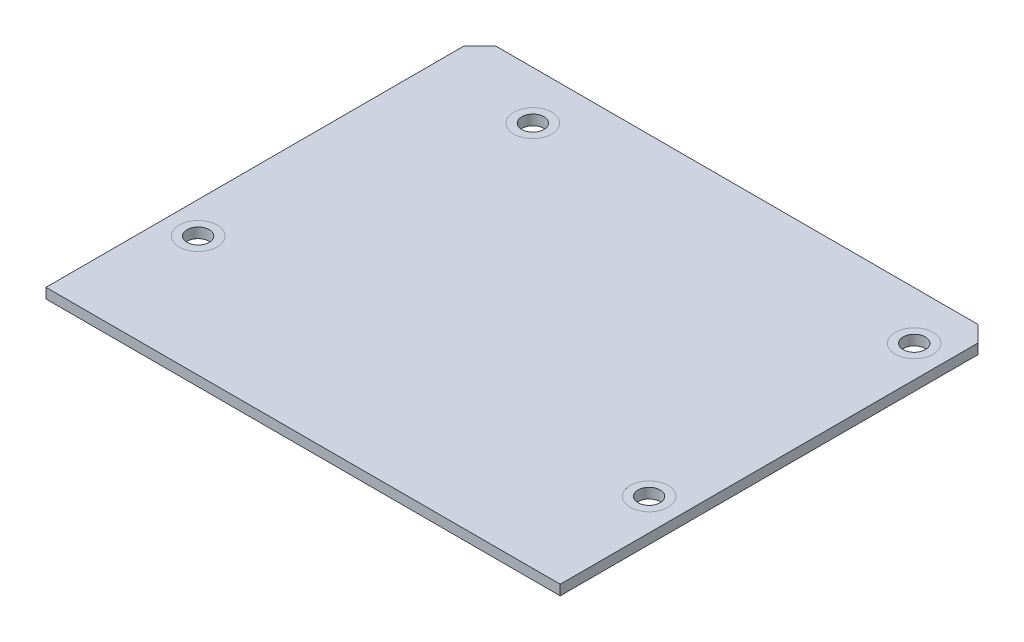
ISO-10303-21;
HEADER;
FILE_DESCRIPTION(('STEP AP214'),'2;1');
FILE_NAME('part.step','',(''),(''),'','','');
FILE_SCHEMA(('AUTOMOTIVE_DESIGN { 1 0 10303 214 1 1 1 1 }'));
ENDSEC;
DATA;
#1=APPLICATION_CONTEXT('core data for automotive mechanical design processes');
#2=APPLICATION_PROTOCOL_DEFINITION('international standard','automotive_design',2000,#1);
#3=PRODUCT_CONTEXT('',#1,'mechanical');
#4=PRODUCT('Part','Part','',(#3));
#5=PRODUCT_RELATED_PRODUCT_CATEGORY('part','',(#4));
#6=PRODUCT_DEFINITION_FORMATION('','',#4);
#7=PRODUCT_DEFINITION_CONTEXT('part definition',#1,'design');
#8=PRODUCT_DEFINITION('design','',#6,#7);
#9=PRODUCT_DEFINITION_SHAPE('','',#8);
#10=(LENGTH_UNIT() NAMED_UNIT(*) SI_UNIT(.MILLI.,.METRE.));
#11=(NAMED_UNIT(*) PLANE_ANGLE_UNIT() SI_UNIT($,.RADIAN.));
#12=(NAMED_UNIT(*) SI_UNIT($,.STERADIAN.) SOLID_ANGLE_UNIT());
#13=UNCERTAINTY_MEASURE_WITH_UNIT(LENGTH_MEASURE(1.E-05),#10,'distance_accuracy_value','');
#14=(GEOMETRIC_REPRESENTATION_CONTEXT(3) GLOBAL_UNCERTAINTY_ASSIGNED_CONTEXT((#13)) GLOBAL_UNIT_ASSIGNED_CONTEXT((#10,
#11,#12)) REPRESENTATION_CONTEXT('',''));
#15=CARTESIAN_POINT('',(0.,0.,0.));
#16=DIRECTION('',(0.,0.,1.));
#17=DIRECTION('',(1.,0.,0.));
#18=AXIS2_PLACEMENT_3D('',#15,#16,#17);
#19=CARTESIAN_POINT('',(35.64,-0.000999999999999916,15.24));
#20=DIRECTION('',(0.,1.,0.));
#21=DIRECTION('',(0.,0.,1.));
#22=AXIS2_PLACEMENT_3D('',#19,#20,#21);
#23=CYLINDRICAL_SURFACE('',#22,1.75);
#24=CARTESIAN_POINT('',(35.64,0.,15.24));
#25=DIRECTION('',(0.,1.,0.));
#26=DIRECTION('',(0.,0.,1.));
#27=AXIS2_PLACEMENT_3D('',#24,#25,#26);
#28=CIRCLE('',#27,1.75);
#29=CARTESIAN_POINT('',(35.64,0.,16.99));
#30=VERTEX_POINT('',#29);
#31=EDGE_CURVE('E168',#30,#30,#28,.F.);
#32=ORIENTED_EDGE('',*,*,#31,.T.);
#33=EDGE_LOOP('',(#32));
#34=FACE_BOUND('',#33,.T.);
#35=CARTESIAN_POINT('',(35.64,1.5999,15.24));
#36=DIRECTION('',(0.,1.,0.));
#37=DIRECTION('',(0.,0.,1.));
#38=AXIS2_PLACEMENT_3D('',#35,#36,#37);
#39=CIRCLE('',#38,1.75);
#40=CARTESIAN_POINT('',(35.64,1.5999,16.99));
#41=VERTEX_POINT('',#40);
#42=EDGE_CURVE('E34',#41,#41,#39,.F.);
#43=ORIENTED_EDGE('',*,*,#42,.F.);
#44=EDGE_LOOP('',(#43));
#45=FACE_BOUND('',#44,.T.);
#46=ADVANCED_FACE('F30',(#34,#45),#23,.F.);
#47=CARTESIAN_POINT('',(-35.64,-0.000999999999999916,15.24));
#48=DIRECTION('',(0.,1.,0.));
#49=DIRECTION('',(0.,0.,1.));
#50=AXIS2_PLACEMENT_3D('',#47,#48,#49);
#51=CYLINDRICAL_SURFACE('',#50,1.75);
#52=CARTESIAN_POINT('',(-35.64,0.,15.24));
#53=DIRECTION('',(0.,1.,0.));
#54=DIRECTION('',(0.,0.,1.));
#55=AXIS2_PLACEMENT_3D('',#52,#53,#54);
#56=CIRCLE('',#55,1.75);
#57=CARTESIAN_POINT('',(-35.64,0.,16.99));
#58=VERTEX_POINT('',#57);
#59=EDGE_CURVE('E135',#58,#58,#56,.F.);
#60=ORIENTED_EDGE('',*,*,#59,.T.);
#61=EDGE_LOOP('',(#60));
#62=FACE_BOUND('',#61,.T.);
#63=CARTESIAN_POINT('',(-35.64,1.5999,15.24));
#64=DIRECTION('',(0.,1.,0.));
#65=DIRECTION('',(0.,0.,1.));
#66=AXIS2_PLACEMENT_3D('',#63,#64,#65);
#67=CIRCLE('',#66,1.75);
#68=CARTESIAN_POINT('',(-35.64,1.5999,16.99));
#69=VERTEX_POINT('',#68);
#70=EDGE_CURVE('E141',#69,#69,#67,.F.);
#71=ORIENTED_EDGE('',*,*,#70,.F.);
#72=EDGE_LOOP('',(#71));
#73=FACE_BOUND('',#72,.T.);
#74=ADVANCED_FACE('F200',(#62,#73),#51,.F.);
#75=CARTESIAN_POINT('',(35.64,-0.000999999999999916,-26.67));
#76=DIRECTION('',(0.,1.,0.));
#77=DIRECTION('',(0.,0.,1.));
#78=AXIS2_PLACEMENT_3D('',#75,#76,#77);
#79=CYLINDRICAL_SURFACE('',#78,1.75);
#80=CARTESIAN_POINT('',(35.64,0.,-26.67));
#81=DIRECTION('',(0.,1.,0.));
#82=DIRECTION('',(0.,0.,1.));
#83=AXIS2_PLACEMENT_3D('',#80,#81,#82);
#84=CIRCLE('',#83,1.75);
#85=CARTESIAN_POINT('',(35.64,0.,-24.92));
#86=VERTEX_POINT('',#85);
#87=EDGE_CURVE('E171',#86,#86,#84,.F.);
#88=ORIENTED_EDGE('',*,*,#87,.T.);
#89=EDGE_LOOP('',(#88));
#90=FACE_BOUND('',#89,.T.);
#91=CARTESIAN_POINT('',(35.64,1.5999,-26.67));
#92=DIRECTION('',(0.,1.,0.));
#93=DIRECTION('',(0.,0.,1.));
#94=AXIS2_PLACEMENT_3D('',#91,#92,#93);
#95=CIRCLE('',#94,1.75);
#96=CARTESIAN_POINT('',(35.64,1.5999,-24.92));
#97=VERTEX_POINT('',#96);
#98=EDGE_CURVE('E137',#97,#97,#95,.F.);
#99=ORIENTED_EDGE('',*,*,#98,.F.);
#100=EDGE_LOOP('',(#99));
#101=FACE_BOUND('',#100,.T.);
#102=ADVANCED_FACE('F207',(#90,#101),#79,.F.);
#103=CARTESIAN_POINT('',(-24.64,-0.000999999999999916,-26.67));
#104=DIRECTION('',(0.,1.,0.));
#105=DIRECTION('',(0.,0.,1.));
#106=AXIS2_PLACEMENT_3D('',#103,#104,#105);
#107=CYLINDRICAL_SURFACE('',#106,1.75);
#108=CARTESIAN_POINT('',(-24.64,0.,-26.67));
#109=DIRECTION('',(0.,1.,0.));
#110=DIRECTION('',(0.,0.,1.));
#111=AXIS2_PLACEMENT_3D('',#108,#109,#110);
#112=CIRCLE('',#111,1.75);
#113=CARTESIAN_POINT('',(-24.64,0.,-24.92));
#114=VERTEX_POINT('',#113);
#115=EDGE_CURVE('E114',#114,#114,#112,.F.);
#116=ORIENTED_EDGE('',*,*,#115,.T.);
#117=EDGE_LOOP('',(#116));
#118=FACE_BOUND('',#117,.T.);
#119=CARTESIAN_POINT('',(-24.64,1.5999,-26.67));
#120=DIRECTION('',(0.,1.,0.));
#121=DIRECTION('',(0.,0.,1.));
#122=AXIS2_PLACEMENT_3D('',#119,#120,#121);
#123=CIRCLE('',#122,1.75);
#124=CARTESIAN_POINT('',(-24.64,1.5999,-24.92));
#125=VERTEX_POINT('',#124);
#126=EDGE_CURVE('E132',#125,#125,#123,.F.);
#127=ORIENTED_EDGE('',*,*,#126,.F.);
#128=EDGE_LOOP('',(#127));
#129=FACE_BOUND('',#128,.T.);
#130=ADVANCED_FACE('F197',(#118,#129),#107,.F.);
#131=CARTESIAN_POINT('',(40.64,1.6,-34.29));
#132=DIRECTION('',(-1.,0.,0.));
#133=DIRECTION('',(0.,0.,1.));
#134=AXIS2_PLACEMENT_3D('',#131,#132,#133);
#135=PLANE('',#134);
#136=DIRECTION('',(0.,0.,-1.));
#137=VECTOR('',#136,1.);
#138=CARTESIAN_POINT('',(40.64,0.,-34.29));
#139=LINE('',#138,#137);
#140=CARTESIAN_POINT('',(40.64,0.,34.29));
#141=VERTEX_POINT('',#140);
#142=CARTESIAN_POINT('',(40.64,0.,-31.75));
#143=VERTEX_POINT('',#142);
#144=EDGE_CURVE('E111',#141,#143,#139,.T.);
#145=ORIENTED_EDGE('',*,*,#144,.T.);
#146=DIRECTION('',(0.,1.,0.));
#147=VECTOR('',#146,1.);
#148=CARTESIAN_POINT('',(40.64,1.6,-31.75));
#149=LINE('',#148,#147);
#150=CARTESIAN_POINT('',(40.64,1.6,-31.75));
#151=VERTEX_POINT('',#150);
#152=EDGE_CURVE('E55',#143,#151,#149,.T.);
#153=ORIENTED_EDGE('',*,*,#152,.T.);
#154=DIRECTION('',(0.,0.,-1.));
#155=VECTOR('',#154,1.);
#156=CARTESIAN_POINT('',(40.64,1.6,-34.29));
#157=LINE('',#156,#155);
#158=CARTESIAN_POINT('',(40.64,1.6,34.29));
#159=VERTEX_POINT('',#158);
#160=EDGE_CURVE('E119',#159,#151,#157,.T.);
#161=ORIENTED_EDGE('',*,*,#160,.F.);
#162=DIRECTION('',(0.,-1.,0.));
#163=VECTOR('',#162,1.);
#164=CARTESIAN_POINT('',(40.64,1.6,34.29));
#165=LINE('',#164,#163);
#166=EDGE_CURVE('E103',#159,#141,#165,.T.);
#167=ORIENTED_EDGE('',*,*,#166,.T.);
#168=EDGE_LOOP('',(#145,#153,#161,#167));
#169=FACE_BOUND('',#168,.T.);
#170=ADVANCED_FACE('F186',(#169),#135,.F.);
#171=CARTESIAN_POINT('',(-40.64,1.6,-34.29));
#172=DIRECTION('',(0.,0.,1.));
#173=DIRECTION('',(1.,0.,0.));
#174=AXIS2_PLACEMENT_3D('',#171,#172,#173);
#175=PLANE('',#174);
#176=DIRECTION('',(-1.,0.,0.));
#177=VECTOR('',#176,1.);
#178=CARTESIAN_POINT('',(-40.64,1.6,-34.29));
#179=LINE('',#178,#177);
#180=CARTESIAN_POINT('',(38.1,1.6,-34.29));
#181=VERTEX_POINT('',#180);
#182=CARTESIAN_POINT('',(-38.1,1.6,-34.29));
#183=VERTEX_POINT('',#182);
#184=EDGE_CURVE('E93',#181,#183,#179,.T.);
#185=ORIENTED_EDGE('',*,*,#184,.F.);
#186=DIRECTION('',(0.,-1.,0.));
#187=VECTOR('',#186,1.);
#188=CARTESIAN_POINT('',(38.1,1.6,-34.29));
#189=LINE('',#188,#187);
#190=CARTESIAN_POINT('',(38.1,0.,-34.29));
#191=VERTEX_POINT('',#190);
#192=EDGE_CURVE('E122',#181,#191,#189,.T.);
#193=ORIENTED_EDGE('',*,*,#192,.T.);
#194=DIRECTION('',(-1.,0.,0.));
#195=VECTOR('',#194,1.);
#196=CARTESIAN_POINT('',(-40.64,0.,-34.29));
#197=LINE('',#196,#195);
#198=CARTESIAN_POINT('',(-38.1,0.,-34.29));
#199=VERTEX_POINT('',#198);
#200=EDGE_CURVE('E113',#191,#199,#197,.T.);
#201=ORIENTED_EDGE('',*,*,#200,.T.);
#202=DIRECTION('',(0.,1.,0.));
#203=VECTOR('',#202,1.);
#204=CARTESIAN_POINT('',(-38.1,1.6,-34.29));
#205=LINE('',#204,#203);
#206=EDGE_CURVE('E102',#199,#183,#205,.T.);
#207=ORIENTED_EDGE('',*,*,#206,.T.);
#208=EDGE_LOOP('',(#185,#193,#201,#207));
#209=FACE_BOUND('',#208,.T.);
#210=ADVANCED_FACE('F189',(#209),#175,.F.);
#211=CARTESIAN_POINT('',(-40.64,1.6,-34.29));
#212=DIRECTION('',(1.,0.,0.));
#213=DIRECTION('',(0.,0.,-1.));
#214=AXIS2_PLACEMENT_3D('',#211,#212,#213);
#215=PLANE('',#214);
#216=DIRECTION('',(0.,0.,1.));
#217=VECTOR('',#216,1.);
#218=CARTESIAN_POINT('',(-40.64,1.6,-34.29));
#219=LINE('',#218,#217);
#220=CARTESIAN_POINT('',(-40.64,1.6,-31.75));
#221=VERTEX_POINT('',#220);
#222=CARTESIAN_POINT('',(-40.64,1.6,34.29));
#223=VERTEX_POINT('',#222);
#224=EDGE_CURVE('E85',#221,#223,#219,.T.);
#225=ORIENTED_EDGE('',*,*,#224,.F.);
#226=DIRECTION('',(0.,-1.,0.));
#227=VECTOR('',#226,1.);
#228=CARTESIAN_POINT('',(-40.64,1.6,-31.75));
#229=LINE('',#228,#227);
#230=CARTESIAN_POINT('',(-40.64,0.,-31.75));
#231=VERTEX_POINT('',#230);
#232=EDGE_CURVE('E11',#221,#231,#229,.T.);
#233=ORIENTED_EDGE('',*,*,#232,.T.);
#234=DIRECTION('',(0.,0.,1.));
#235=VECTOR('',#234,1.);
#236=CARTESIAN_POINT('',(-40.64,0.,-34.29));
#237=LINE('',#236,#235);
#238=CARTESIAN_POINT('',(-40.64,0.,34.29));
#239=VERTEX_POINT('',#238);
#240=EDGE_CURVE('E99',#231,#239,#237,.T.);
#241=ORIENTED_EDGE('',*,*,#240,.T.);
#242=DIRECTION('',(0.,-1.,0.));
#243=VECTOR('',#242,1.);
#244=CARTESIAN_POINT('',(-40.64,1.6,34.29));
#245=LINE('',#244,#243);
#246=EDGE_CURVE('E96',#223,#239,#245,.T.);
#247=ORIENTED_EDGE('',*,*,#246,.F.);
#248=EDGE_LOOP('',(#225,#233,#241,#247));
#249=FACE_BOUND('',#248,.T.);
#250=ADVANCED_FACE('F97',(#249),#215,.F.);
#251=CARTESIAN_POINT('',(-40.64,1.6,34.29));
#252=DIRECTION('',(0.,0.,-1.));
#253=DIRECTION('',(-1.,0.,0.));
#254=AXIS2_PLACEMENT_3D('',#251,#252,#253);
#255=PLANE('',#254);
#256=DIRECTION('',(1.,0.,0.));
#257=VECTOR('',#256,1.);
#258=CARTESIAN_POINT('',(-40.64,0.,34.29));
#259=LINE('',#258,#257);
#260=EDGE_CURVE('E118',#239,#141,#259,.T.);
#261=ORIENTED_EDGE('',*,*,#260,.T.);
#262=ORIENTED_EDGE('',*,*,#166,.F.);
#263=DIRECTION('',(1.,0.,0.));
#264=VECTOR('',#263,1.);
#265=CARTESIAN_POINT('',(-40.64,1.6,34.29));
#266=LINE('',#265,#264);
#267=EDGE_CURVE('E89',#223,#159,#266,.T.);
#268=ORIENTED_EDGE('',*,*,#267,.F.);
#269=ORIENTED_EDGE('',*,*,#246,.T.);
#270=EDGE_LOOP('',(#261,#262,#268,#269));
#271=FACE_BOUND('',#270,.T.);
#272=ADVANCED_FACE('F105',(#271),#255,.F.);
#273=CARTESIAN_POINT('',(40.64,1.6,34.29));
#274=DIRECTION('',(0.,1.,0.));
#275=DIRECTION('',(0.,0.,1.));
#276=AXIS2_PLACEMENT_3D('',#273,#274,#275);
#277=PLANE('',#276);
#278=CARTESIAN_POINT('',(35.64,1.6,15.24));
#279=DIRECTION('',(0.,1.,0.));
#280=DIRECTION('',(0.,0.,1.));
#281=AXIS2_PLACEMENT_3D('',#278,#279,#280);
#282=CIRCLE('',#281,3.);
#283=CARTESIAN_POINT('',(35.64,1.6,18.24));
#284=VERTEX_POINT('',#283);
#285=EDGE_CURVE('E157',#284,#284,#282,.T.);
#286=ORIENTED_EDGE('',*,*,#285,.F.);
#287=EDGE_LOOP('',(#286));
#288=FACE_BOUND('',#287,.T.);
#289=CARTESIAN_POINT('',(-35.64,1.6,15.24));
#290=DIRECTION('',(0.,1.,0.));
#291=DIRECTION('',(0.,0.,1.));
#292=AXIS2_PLACEMENT_3D('',#289,#290,#291);
#293=CIRCLE('',#292,3.);
#294=CARTESIAN_POINT('',(-35.64,1.6,18.24));
#295=VERTEX_POINT('',#294);
#296=EDGE_CURVE('E150',#295,#295,#293,.T.);
#297=ORIENTED_EDGE('',*,*,#296,.F.);
#298=EDGE_LOOP('',(#297));
#299=FACE_BOUND('',#298,.T.);
#300=CARTESIAN_POINT('',(35.64,1.6,-26.67));
#301=DIRECTION('',(0.,1.,0.));
#302=DIRECTION('',(0.,0.,1.));
#303=AXIS2_PLACEMENT_3D('',#300,#301,#302);
#304=CIRCLE('',#303,3.);
#305=CARTESIAN_POINT('',(35.64,1.6,-23.67));
#306=VERTEX_POINT('',#305);
#307=EDGE_CURVE('E143',#306,#306,#304,.T.);
#308=ORIENTED_EDGE('',*,*,#307,.F.);
#309=EDGE_LOOP('',(#308));
#310=FACE_BOUND('',#309,.T.);
#311=CARTESIAN_POINT('',(-24.64,1.6,-26.67));
#312=DIRECTION('',(0.,1.,0.));
#313=DIRECTION('',(0.,0.,1.));
#314=AXIS2_PLACEMENT_3D('',#311,#312,#313);
#315=CIRCLE('',#314,3.);
#316=CARTESIAN_POINT('',(-24.64,1.6,-23.67));
#317=VERTEX_POINT('',#316);
#318=EDGE_CURVE('E139',#317,#317,#315,.T.);
#319=ORIENTED_EDGE('',*,*,#318,.F.);
#320=EDGE_LOOP('',(#319));
#321=FACE_BOUND('',#320,.T.);
#322=ORIENTED_EDGE('',*,*,#160,.T.);
#323=DIRECTION('',(0.707106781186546,0.,0.707106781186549));
#324=VECTOR('',#323,1.);
#325=CARTESIAN_POINT('',(73.66,1.6,1.27000000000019));
#326=LINE('',#325,#324);
#327=EDGE_CURVE('E39',#151,#181,#326,.F.);
#328=ORIENTED_EDGE('',*,*,#327,.T.);
#329=ORIENTED_EDGE('',*,*,#184,.T.);
#330=DIRECTION('',(0.707106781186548,0.,-0.707106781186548));
#331=VECTOR('',#330,1.);
#332=CARTESIAN_POINT('',(-33.02,1.6,-39.37));
#333=LINE('',#332,#331);
#334=EDGE_CURVE('E47',#183,#221,#333,.F.);
#335=ORIENTED_EDGE('',*,*,#334,.T.);
#336=ORIENTED_EDGE('',*,*,#224,.T.);
#337=ORIENTED_EDGE('',*,*,#267,.T.);
#338=EDGE_LOOP('',(#322,#328,#329,#335,#336,#337));
#339=FACE_BOUND('',#338,.T.);
#340=ADVANCED_FACE('F87',(#288,#299,#310,#321,#339),#277,.T.);
#341=CARTESIAN_POINT('',(40.64,0.,34.29));
#342=DIRECTION('',(0.,1.,0.));
#343=DIRECTION('',(0.,0.,1.));
#344=AXIS2_PLACEMENT_3D('',#341,#342,#343);
#345=PLANE('',#344);
#346=ORIENTED_EDGE('',*,*,#59,.F.);
#347=EDGE_LOOP('',(#346));
#348=FACE_BOUND('',#347,.T.);
#349=ORIENTED_EDGE('',*,*,#31,.F.);
#350=EDGE_LOOP('',(#349));
#351=FACE_BOUND('',#350,.T.);
#352=ORIENTED_EDGE('',*,*,#87,.F.);
#353=EDGE_LOOP('',(#352));
#354=FACE_BOUND('',#353,.T.);
#355=ORIENTED_EDGE('',*,*,#115,.F.);
#356=EDGE_LOOP('',(#355));
#357=FACE_BOUND('',#356,.T.);
#358=ORIENTED_EDGE('',*,*,#200,.F.);
#359=DIRECTION('',(-0.707106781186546,0.,-0.707106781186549));
#360=VECTOR('',#359,1.);
#361=CARTESIAN_POINT('',(38.1,0.,-34.29));
#362=LINE('',#361,#360);
#363=EDGE_CURVE('E127',#191,#143,#362,.F.);
#364=ORIENTED_EDGE('',*,*,#363,.T.);
#365=ORIENTED_EDGE('',*,*,#144,.F.);
#366=ORIENTED_EDGE('',*,*,#260,.F.);
#367=ORIENTED_EDGE('',*,*,#240,.F.);
#368=DIRECTION('',(-0.707106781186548,0.,0.707106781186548));
#369=VECTOR('',#368,1.);
#370=CARTESIAN_POINT('',(-40.64,0.,-31.75));
#371=LINE('',#370,#369);
#372=EDGE_CURVE('E125',#231,#199,#371,.F.);
#373=ORIENTED_EDGE('',*,*,#372,.T.);
#374=EDGE_LOOP('',(#358,#364,#365,#366,#367,#373));
#375=FACE_BOUND('',#374,.T.);
#376=ADVANCED_FACE('F184',(#348,#351,#354,#357,#375),#345,.F.);
#377=CARTESIAN_POINT('',(38.1,1.6,-34.29));
#378=DIRECTION('',(-0.707106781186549,0.,0.707106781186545));
#379=DIRECTION('',(0.707106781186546,0.,0.707106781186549));
#380=AXIS2_PLACEMENT_3D('',#377,#378,#379);
#381=PLANE('',#380);
#382=ORIENTED_EDGE('',*,*,#327,.F.);
#383=ORIENTED_EDGE('',*,*,#152,.F.);
#384=ORIENTED_EDGE('',*,*,#363,.F.);
#385=ORIENTED_EDGE('',*,*,#192,.F.);
#386=EDGE_LOOP('',(#382,#383,#384,#385));
#387=FACE_BOUND('',#386,.T.);
#388=ADVANCED_FACE('F188',(#387),#381,.F.);
#389=CARTESIAN_POINT('',(-40.64,1.6,-31.75));
#390=DIRECTION('',(0.707106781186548,0.,0.707106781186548));
#391=DIRECTION('',(0.707106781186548,0.,-0.707106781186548));
#392=AXIS2_PLACEMENT_3D('',#389,#390,#391);
#393=PLANE('',#392);
#394=ORIENTED_EDGE('',*,*,#334,.F.);
#395=ORIENTED_EDGE('',*,*,#206,.F.);
#396=ORIENTED_EDGE('',*,*,#372,.F.);
#397=ORIENTED_EDGE('',*,*,#232,.F.);
#398=EDGE_LOOP('',(#394,#395,#396,#397));
#399=FACE_BOUND('',#398,.T.);
#400=ADVANCED_FACE('F32',(#399),#393,.F.);
#401=CARTESIAN_POINT('',(-24.64,1.5999,-26.67));
#402=DIRECTION('',(0.,1.,0.));
#403=DIRECTION('',(0.,0.,1.));
#404=AXIS2_PLACEMENT_3D('',#401,#402,#403);
#405=PLANE('',#404);
#406=CARTESIAN_POINT('',(-24.64,1.5999,-26.67));
#407=DIRECTION('',(0.,1.,0.));
#408=DIRECTION('',(0.,0.,1.));
#409=AXIS2_PLACEMENT_3D('',#406,#407,#408);
#410=CIRCLE('',#409,3.);
#411=CARTESIAN_POINT('',(-24.64,1.5999,-23.67));
#412=VERTEX_POINT('',#411);
#413=EDGE_CURVE('E136',#412,#412,#410,.T.);
#414=ORIENTED_EDGE('',*,*,#413,.T.);
#415=EDGE_LOOP('',(#414));
#416=FACE_BOUND('',#415,.T.);
#417=ORIENTED_EDGE('',*,*,#126,.T.);
#418=EDGE_LOOP('',(#417));
#419=FACE_BOUND('',#418,.T.);
#420=ADVANCED_FACE('F254',(#416,#419),#405,.T.);
#421=CARTESIAN_POINT('',(-24.64,1.5999,-26.67));
#422=DIRECTION('',(0.,1.,0.));
#423=DIRECTION('',(0.,0.,1.));
#424=AXIS2_PLACEMENT_3D('',#421,#422,#423);
#425=CYLINDRICAL_SURFACE('',#424,3.);
#426=ORIENTED_EDGE('',*,*,#413,.F.);
#427=EDGE_LOOP('',(#426));
#428=FACE_BOUND('',#427,.T.);
#429=ORIENTED_EDGE('',*,*,#318,.T.);
#430=EDGE_LOOP('',(#429));
#431=FACE_BOUND('',#430,.T.);
#432=ADVANCED_FACE('F284',(#428,#431),#425,.F.);
#433=CARTESIAN_POINT('',(35.64,1.5999,-26.67));
#434=DIRECTION('',(0.,1.,0.));
#435=DIRECTION('',(0.,0.,1.));
#436=AXIS2_PLACEMENT_3D('',#433,#434,#435);
#437=PLANE('',#436);
#438=CARTESIAN_POINT('',(35.64,1.5999,-26.67));
#439=DIRECTION('',(0.,1.,0.));
#440=DIRECTION('',(0.,0.,1.));
#441=AXIS2_PLACEMENT_3D('',#438,#439,#440);
#442=CIRCLE('',#441,3.);
#443=CARTESIAN_POINT('',(35.64,1.5999,-23.67));
#444=VERTEX_POINT('',#443);
#445=EDGE_CURVE('E140',#444,#444,#442,.T.);
#446=ORIENTED_EDGE('',*,*,#445,.T.);
#447=EDGE_LOOP('',(#446));
#448=FACE_BOUND('',#447,.T.);
#449=ORIENTED_EDGE('',*,*,#98,.T.);
#450=EDGE_LOOP('',(#449));
#451=FACE_BOUND('',#450,.T.);
#452=ADVANCED_FACE('F293',(#448,#451),#437,.T.);
#453=CARTESIAN_POINT('',(35.64,1.5999,-26.67));
#454=DIRECTION('',(0.,1.,0.));
#455=DIRECTION('',(0.,0.,1.));
#456=AXIS2_PLACEMENT_3D('',#453,#454,#455);
#457=CYLINDRICAL_SURFACE('',#456,3.);
#458=ORIENTED_EDGE('',*,*,#445,.F.);
#459=EDGE_LOOP('',(#458));
#460=FACE_BOUND('',#459,.T.);
#461=ORIENTED_EDGE('',*,*,#307,.T.);
#462=EDGE_LOOP('',(#461));
#463=FACE_BOUND('',#462,.T.);
#464=ADVANCED_FACE('F301',(#460,#463),#457,.F.);
#465=CARTESIAN_POINT('',(-35.64,1.5999,15.24));
#466=DIRECTION('',(0.,1.,0.));
#467=DIRECTION('',(0.,0.,1.));
#468=AXIS2_PLACEMENT_3D('',#465,#466,#467);
#469=PLANE('',#468);
#470=CARTESIAN_POINT('',(-35.64,1.5999,15.24));
#471=DIRECTION('',(0.,1.,0.));
#472=DIRECTION('',(0.,0.,1.));
#473=AXIS2_PLACEMENT_3D('',#470,#471,#472);
#474=CIRCLE('',#473,3.);
#475=CARTESIAN_POINT('',(-35.64,1.5999,18.24));
#476=VERTEX_POINT('',#475);
#477=EDGE_CURVE('E144',#476,#476,#474,.T.);
#478=ORIENTED_EDGE('',*,*,#477,.T.);
#479=EDGE_LOOP('',(#478));
#480=FACE_BOUND('',#479,.T.);
#481=ORIENTED_EDGE('',*,*,#70,.T.);
#482=EDGE_LOOP('',(#481));
#483=FACE_BOUND('',#482,.T.);
#484=ADVANCED_FACE('F310',(#480,#483),#469,.T.);
#485=CARTESIAN_POINT('',(-35.64,1.5999,15.24));
#486=DIRECTION('',(0.,1.,0.));
#487=DIRECTION('',(0.,0.,1.));
#488=AXIS2_PLACEMENT_3D('',#485,#486,#487);
#489=CYLINDRICAL_SURFACE('',#488,3.);
#490=ORIENTED_EDGE('',*,*,#477,.F.);
#491=EDGE_LOOP('',(#490));
#492=FACE_BOUND('',#491,.T.);
#493=ORIENTED_EDGE('',*,*,#296,.T.);
#494=EDGE_LOOP('',(#493));
#495=FACE_BOUND('',#494,.T.);
#496=ADVANCED_FACE('F319',(#492,#495),#489,.F.);
#497=CARTESIAN_POINT('',(35.64,1.5999,15.24));
#498=DIRECTION('',(0.,1.,0.));
#499=DIRECTION('',(0.,0.,1.));
#500=AXIS2_PLACEMENT_3D('',#497,#498,#499);
#501=PLANE('',#500);
#502=CARTESIAN_POINT('',(35.64,1.5999,15.24));
#503=DIRECTION('',(0.,1.,0.));
#504=DIRECTION('',(0.,0.,1.));
#505=AXIS2_PLACEMENT_3D('',#502,#503,#504);
#506=CIRCLE('',#505,3.);
#507=CARTESIAN_POINT('',(35.64,1.5999,18.24));
#508=VERTEX_POINT('',#507);
#509=EDGE_CURVE('E361',#508,#508,#506,.T.);
#510=ORIENTED_EDGE('',*,*,#509,.T.);
#511=EDGE_LOOP('',(#510));
#512=FACE_BOUND('',#511,.T.);
#513=ORIENTED_EDGE('',*,*,#42,.T.);
#514=EDGE_LOOP('',(#513));
#515=FACE_BOUND('',#514,.T.);
#516=ADVANCED_FACE('F327',(#512,#515),#501,.T.);
#517=CARTESIAN_POINT('',(35.64,1.5999,15.24));
#518=DIRECTION('',(0.,1.,0.));
#519=DIRECTION('',(0.,0.,1.));
#520=AXIS2_PLACEMENT_3D('',#517,#518,#519);
#521=CYLINDRICAL_SURFACE('',#520,3.);
#522=ORIENTED_EDGE('',*,*,#509,.F.);
#523=EDGE_LOOP('',(#522));
#524=FACE_BOUND('',#523,.T.);
#525=ORIENTED_EDGE('',*,*,#285,.T.);
#526=EDGE_LOOP('',(#525));
#527=FACE_BOUND('',#526,.T.);
#528=ADVANCED_FACE('F336',(#524,#527),#521,.F.);
#529=CLOSED_SHELL('',(#46,#74,#102,#130,#170,#210,#250,#272,#340,#376,#388,#400,#420,#432,#452,
#464,#484,#496,#516,#528));
#530=MANIFOLD_SOLID_BREP('B2',#529);
#531=ADVANCED_BREP_SHAPE_REPRESENTATION('',(#18,#530),#14);
#532=SHAPE_DEFINITION_REPRESENTATION(#9,#531);
ENDSEC;
END-ISO-10303-21;
